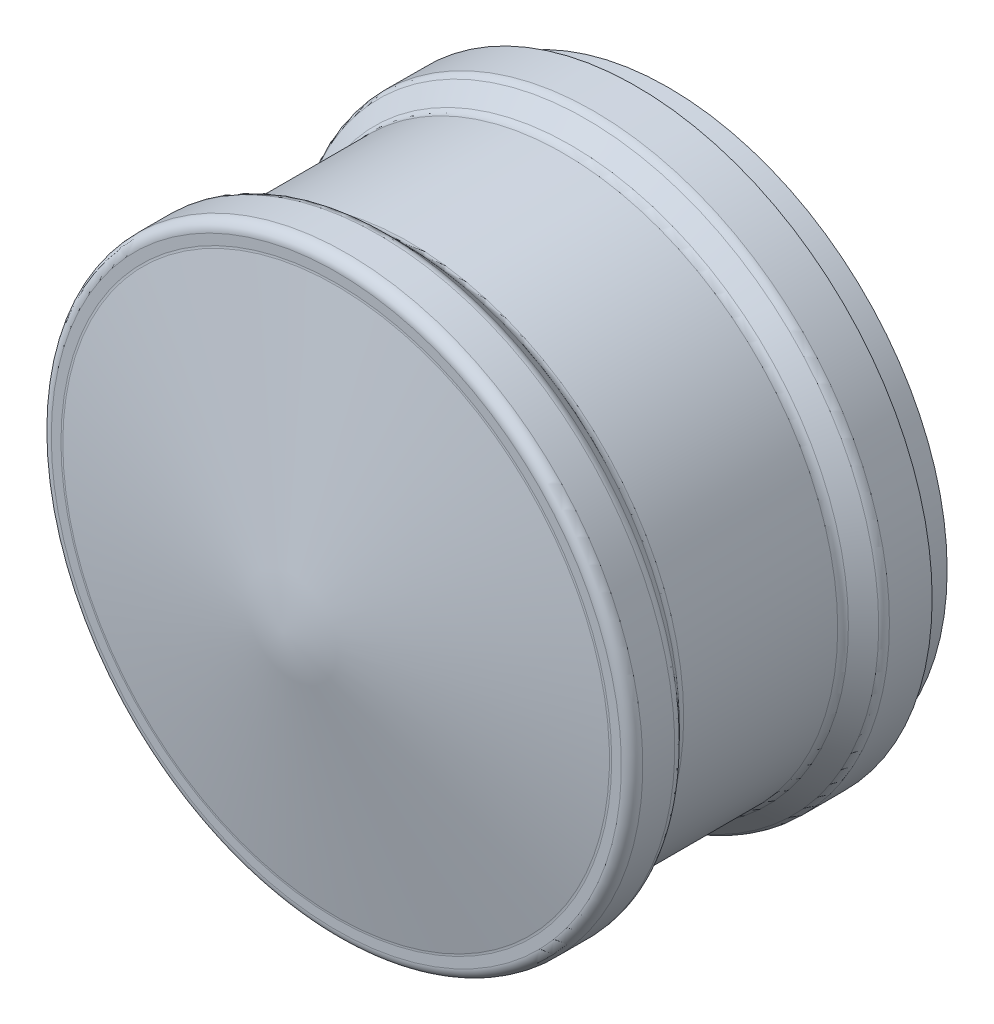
ISO-10303-21;
HEADER;
FILE_DESCRIPTION(('STEP AP214'),'2;1');
FILE_NAME('part.step','',(''),(''),'','','');
FILE_SCHEMA(('AUTOMOTIVE_DESIGN { 1 0 10303 214 1 1 1 1 }'));
ENDSEC;
DATA;
#1=APPLICATION_CONTEXT('core data for automotive mechanical design processes');
#2=APPLICATION_PROTOCOL_DEFINITION('international standard','automotive_design',2000,#1);
#3=PRODUCT_CONTEXT('',#1,'mechanical');
#4=PRODUCT('Part','Part','',(#3));
#5=PRODUCT_RELATED_PRODUCT_CATEGORY('part','',(#4));
#6=PRODUCT_DEFINITION_FORMATION('','',#4);
#7=PRODUCT_DEFINITION_CONTEXT('part definition',#1,'design');
#8=PRODUCT_DEFINITION('design','',#6,#7);
#9=PRODUCT_DEFINITION_SHAPE('','',#8);
#10=(LENGTH_UNIT() NAMED_UNIT(*) SI_UNIT(.MILLI.,.METRE.));
#11=(NAMED_UNIT(*) PLANE_ANGLE_UNIT() SI_UNIT($,.RADIAN.));
#12=(NAMED_UNIT(*) SI_UNIT($,.STERADIAN.) SOLID_ANGLE_UNIT());
#13=UNCERTAINTY_MEASURE_WITH_UNIT(LENGTH_MEASURE(1.E-05),#10,'distance_accuracy_value','');
#14=(GEOMETRIC_REPRESENTATION_CONTEXT(3) GLOBAL_UNCERTAINTY_ASSIGNED_CONTEXT((#13)) GLOBAL_UNIT_ASSIGNED_CONTEXT((#10,
#11,#12)) REPRESENTATION_CONTEXT('',''));
#15=CARTESIAN_POINT('',(0.,0.,0.));
#16=DIRECTION('',(0.,0.,1.));
#17=DIRECTION('',(1.,0.,0.));
#18=AXIS2_PLACEMENT_3D('',#15,#16,#17);
#19=CARTESIAN_POINT('',(0.,12.8,15.5));
#20=DIRECTION('',(0.,0.,-1.));
#21=DIRECTION('',(-1.,0.,0.));
#22=AXIS2_PLACEMENT_3D('',#19,#20,#21);
#23=PLANE('',#22);
#24=CARTESIAN_POINT('',(0.,0.,15.5));
#25=DIRECTION('',(0.,0.,-1.));
#26=DIRECTION('',(-1.,0.,0.));
#27=AXIS2_PLACEMENT_3D('',#24,#25,#26);
#28=CIRCLE('',#27,12.8483711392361);
#29=CARTESIAN_POINT('',(-12.8483711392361,0.,15.5));
#30=VERTEX_POINT('',#29);
#31=EDGE_CURVE('E156',#30,#30,#28,.T.);
#32=ORIENTED_EDGE('',*,*,#31,.T.);
#33=EDGE_LOOP('',(#32));
#34=FACE_BOUND('',#33,.T.);
#35=CARTESIAN_POINT('',(0.,0.,15.5));
#36=DIRECTION('',(0.,0.,-1.));
#37=DIRECTION('',(-1.,0.,0.));
#38=AXIS2_PLACEMENT_3D('',#35,#36,#37);
#39=CIRCLE('',#38,13.3);
#40=CARTESIAN_POINT('',(-13.3,0.,15.5));
#41=VERTEX_POINT('',#40);
#42=EDGE_CURVE('E153',#41,#41,#39,.F.);
#43=ORIENTED_EDGE('',*,*,#42,.T.);
#44=EDGE_LOOP('',(#43));
#45=FACE_BOUND('',#44,.T.);
#46=ADVANCED_FACE('F35',(#34,#45),#23,.F.);
#47=CARTESIAN_POINT('',(0.,0.,40.1566801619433));
#48=DIRECTION('',(0.,0.,1.));
#49=DIRECTION('',(1.,0.,0.));
#50=AXIS2_PLACEMENT_3D('',#47,#48,#49);
#51=CYLINDRICAL_SURFACE('',#50,13.8);
#52=CARTESIAN_POINT('',(0.,0.,15.));
#53=DIRECTION('',(0.,0.,-1.));
#54=DIRECTION('',(-1.,0.,0.));
#55=AXIS2_PLACEMENT_3D('',#52,#53,#54);
#56=CIRCLE('',#55,13.8);
#57=CARTESIAN_POINT('',(-13.8,0.,15.));
#58=VERTEX_POINT('',#57);
#59=EDGE_CURVE('E161',#58,#58,#56,.T.);
#60=ORIENTED_EDGE('',*,*,#59,.T.);
#61=EDGE_LOOP('',(#60));
#62=FACE_BOUND('',#61,.T.);
#63=CARTESIAN_POINT('',(0.,0.,13.5071067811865));
#64=DIRECTION('',(0.,0.,-1.));
#65=DIRECTION('',(-1.,0.,0.));
#66=AXIS2_PLACEMENT_3D('',#63,#64,#65);
#67=CIRCLE('',#66,13.8);
#68=CARTESIAN_POINT('',(-13.8,0.,13.5071067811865));
#69=VERTEX_POINT('',#68);
#70=EDGE_CURVE('E158',#69,#69,#67,.F.);
#71=ORIENTED_EDGE('',*,*,#70,.T.);
#72=EDGE_LOOP('',(#71));
#73=FACE_BOUND('',#72,.T.);
#74=ADVANCED_FACE('F67',(#62,#73),#51,.T.);
#75=CARTESIAN_POINT('',(0.,0.,12.3));
#76=DIRECTION('',(0.,0.,1.));
#77=DIRECTION('',(1.,0.,0.));
#78=AXIS2_PLACEMENT_3D('',#75,#76,#77);
#79=CONICAL_SURFACE('',#78,12.8,0.78539816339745);
#80=CARTESIAN_POINT('',(0.,0.,13.1535533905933));
#81=DIRECTION('',(0.,0.,-1.));
#82=DIRECTION('',(-1.,0.,0.));
#83=AXIS2_PLACEMENT_3D('',#80,#81,#82);
#84=CIRCLE('',#83,13.6535533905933);
#85=CARTESIAN_POINT('',(-13.6535533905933,0.,13.1535533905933));
#86=VERTEX_POINT('',#85);
#87=EDGE_CURVE('E109',#86,#86,#84,.T.);
#88=ORIENTED_EDGE('',*,*,#87,.T.);
#89=EDGE_LOOP('',(#88));
#90=FACE_BOUND('',#89,.T.);
#91=CARTESIAN_POINT('',(0.,0.,12.4464466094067));
#92=DIRECTION('',(0.,0.,1.));
#93=DIRECTION('',(1.,0.,0.));
#94=AXIS2_PLACEMENT_3D('',#91,#92,#93);
#95=CIRCLE('',#94,12.9464466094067);
#96=CARTESIAN_POINT('',(12.9464466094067,0.,12.4464466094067));
#97=VERTEX_POINT('',#96);
#98=EDGE_CURVE('E107',#97,#97,#95,.T.);
#99=ORIENTED_EDGE('',*,*,#98,.T.);
#100=EDGE_LOOP('',(#99));
#101=FACE_BOUND('',#100,.T.);
#102=ADVANCED_FACE('F73',(#90,#101),#79,.T.);
#103=CARTESIAN_POINT('',(0.,0.,40.1566801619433));
#104=DIRECTION('',(0.,0.,1.));
#105=DIRECTION('',(1.,0.,0.));
#106=AXIS2_PLACEMENT_3D('',#103,#104,#105);
#107=CYLINDRICAL_SURFACE('',#106,12.8);
#108=CARTESIAN_POINT('',(0.,0.,4.90710678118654));
#109=DIRECTION('',(0.,0.,1.));
#110=DIRECTION('',(1.,0.,0.));
#111=AXIS2_PLACEMENT_3D('',#108,#109,#110);
#112=CIRCLE('',#111,12.8);
#113=CARTESIAN_POINT('',(12.8,0.,4.90710678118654));
#114=VERTEX_POINT('',#113);
#115=EDGE_CURVE('E165',#114,#114,#112,.T.);
#116=ORIENTED_EDGE('',*,*,#115,.T.);
#117=EDGE_LOOP('',(#116));
#118=FACE_BOUND('',#117,.T.);
#119=CARTESIAN_POINT('',(0.,0.,12.0928932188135));
#120=DIRECTION('',(0.,0.,1.));
#121=DIRECTION('',(1.,0.,0.));
#122=AXIS2_PLACEMENT_3D('',#119,#120,#121);
#123=CIRCLE('',#122,12.8);
#124=CARTESIAN_POINT('',(12.8,0.,12.0928932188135));
#125=VERTEX_POINT('',#124);
#126=EDGE_CURVE('E104',#125,#125,#123,.F.);
#127=ORIENTED_EDGE('',*,*,#126,.T.);
#128=EDGE_LOOP('',(#127));
#129=FACE_BOUND('',#128,.T.);
#130=ADVANCED_FACE('F178',(#118,#129),#107,.T.);
#131=CARTESIAN_POINT('',(0.,0.,3.69999999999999));
#132=DIRECTION('',(0.,0.,-1.));
#133=DIRECTION('',(-1.,0.,0.));
#134=AXIS2_PLACEMENT_3D('',#131,#132,#133);
#135=CONICAL_SURFACE('',#134,13.8,0.785398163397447);
#136=CARTESIAN_POINT('',(0.,0.,4.55355339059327));
#137=DIRECTION('',(0.,0.,-1.));
#138=DIRECTION('',(-1.,0.,0.));
#139=AXIS2_PLACEMENT_3D('',#136,#137,#138);
#140=CIRCLE('',#139,12.9464466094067);
#141=CARTESIAN_POINT('',(-12.9464466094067,0.,4.55355339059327));
#142=VERTEX_POINT('',#141);
#143=EDGE_CURVE('E115',#142,#142,#140,.T.);
#144=ORIENTED_EDGE('',*,*,#143,.T.);
#145=EDGE_LOOP('',(#144));
#146=FACE_BOUND('',#145,.T.);
#147=CARTESIAN_POINT('',(0.,0.,3.84644660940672));
#148=DIRECTION('',(0.,0.,1.));
#149=DIRECTION('',(1.,0.,0.));
#150=AXIS2_PLACEMENT_3D('',#147,#148,#149);
#151=CIRCLE('',#150,13.6535533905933);
#152=CARTESIAN_POINT('',(13.6535533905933,0.,3.84644660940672));
#153=VERTEX_POINT('',#152);
#154=EDGE_CURVE('E168',#153,#153,#151,.T.);
#155=ORIENTED_EDGE('',*,*,#154,.T.);
#156=EDGE_LOOP('',(#155));
#157=FACE_BOUND('',#156,.T.);
#158=ADVANCED_FACE('F173',(#146,#157),#135,.T.);
#159=CARTESIAN_POINT('',(0.,0.,40.1566801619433));
#160=DIRECTION('',(0.,0.,1.));
#161=DIRECTION('',(1.,0.,0.));
#162=AXIS2_PLACEMENT_3D('',#159,#160,#161);
#163=CYLINDRICAL_SURFACE('',#162,13.8);
#164=CARTESIAN_POINT('',(0.,0.,3.49289321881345));
#165=DIRECTION('',(0.,0.,-1.));
#166=DIRECTION('',(-1.,0.,0.));
#167=AXIS2_PLACEMENT_3D('',#164,#165,#166);
#168=CIRCLE('',#167,13.8);
#169=CARTESIAN_POINT('',(-13.8,0.,3.49289321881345));
#170=VERTEX_POINT('',#169);
#171=EDGE_CURVE('E110',#170,#170,#168,.T.);
#172=ORIENTED_EDGE('',*,*,#171,.T.);
#173=EDGE_LOOP('',(#172));
#174=FACE_BOUND('',#173,.T.);
#175=CARTESIAN_POINT('',(0.,0.,1.5));
#176=DIRECTION('',(0.,0.,1.));
#177=DIRECTION('',(1.,0.,0.));
#178=AXIS2_PLACEMENT_3D('',#175,#176,#177);
#179=CIRCLE('',#178,13.8);
#180=CARTESIAN_POINT('',(13.8,0.,1.5));
#181=VERTEX_POINT('',#180);
#182=EDGE_CURVE('E148',#181,#181,#179,.T.);
#183=ORIENTED_EDGE('',*,*,#182,.T.);
#184=EDGE_LOOP('',(#183));
#185=FACE_BOUND('',#184,.T.);
#186=ADVANCED_FACE('F186',(#174,#185),#163,.T.);
#187=CARTESIAN_POINT('',(0.,13.8,1.5));
#188=DIRECTION('',(0.,0.,1.));
#189=DIRECTION('',(1.,0.,0.));
#190=AXIS2_PLACEMENT_3D('',#187,#188,#189);
#191=PLANE('',#190);
#192=ORIENTED_EDGE('',*,*,#182,.F.);
#193=EDGE_LOOP('',(#192));
#194=FACE_BOUND('',#193,.T.);
#195=CARTESIAN_POINT('',(0.,0.,1.5));
#196=DIRECTION('',(0.,0.,1.));
#197=DIRECTION('',(1.,0.,0.));
#198=AXIS2_PLACEMENT_3D('',#195,#196,#197);
#199=CIRCLE('',#198,12.5);
#200=CARTESIAN_POINT('',(12.5,0.,1.5));
#201=VERTEX_POINT('',#200);
#202=EDGE_CURVE('E145',#201,#201,#199,.T.);
#203=ORIENTED_EDGE('',*,*,#202,.T.);
#204=EDGE_LOOP('',(#203));
#205=FACE_BOUND('',#204,.T.);
#206=ADVANCED_FACE('F192',(#194,#205),#191,.F.);
#207=CARTESIAN_POINT('',(0.,0.,40.1566801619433));
#208=DIRECTION('',(0.,0.,1.));
#209=DIRECTION('',(1.,0.,0.));
#210=AXIS2_PLACEMENT_3D('',#207,#208,#209);
#211=CYLINDRICAL_SURFACE('',#210,12.5);
#212=ORIENTED_EDGE('',*,*,#202,.F.);
#213=EDGE_LOOP('',(#212));
#214=FACE_BOUND('',#213,.T.);
#215=CARTESIAN_POINT('',(0.,0.,1.2));
#216=DIRECTION('',(0.,0.,1.));
#217=DIRECTION('',(1.,0.,0.));
#218=AXIS2_PLACEMENT_3D('',#215,#216,#217);
#219=CIRCLE('',#218,12.5);
#220=CARTESIAN_POINT('',(12.5,0.,1.2));
#221=VERTEX_POINT('',#220);
#222=EDGE_CURVE('E136',#221,#221,#219,.T.);
#223=ORIENTED_EDGE('',*,*,#222,.T.);
#224=EDGE_LOOP('',(#223));
#225=FACE_BOUND('',#224,.T.);
#226=ADVANCED_FACE('F196',(#214,#225),#211,.T.);
#227=CARTESIAN_POINT('',(0.,12.5,1.2));
#228=DIRECTION('',(0.,0.,-1.));
#229=DIRECTION('',(-1.,0.,0.));
#230=AXIS2_PLACEMENT_3D('',#227,#228,#229);
#231=PLANE('',#230);
#232=ORIENTED_EDGE('',*,*,#222,.F.);
#233=EDGE_LOOP('',(#232));
#234=FACE_BOUND('',#233,.T.);
#235=CARTESIAN_POINT('',(0.,0.,1.2));
#236=DIRECTION('',(0.,0.,1.));
#237=DIRECTION('',(1.,0.,0.));
#238=AXIS2_PLACEMENT_3D('',#235,#236,#237);
#239=CIRCLE('',#238,13.);
#240=CARTESIAN_POINT('',(13.,0.,1.2));
#241=VERTEX_POINT('',#240);
#242=EDGE_CURVE('E132',#241,#241,#239,.T.);
#243=ORIENTED_EDGE('',*,*,#242,.T.);
#244=EDGE_LOOP('',(#243));
#245=FACE_BOUND('',#244,.T.);
#246=ADVANCED_FACE('F200',(#234,#245),#231,.F.);
#247=CARTESIAN_POINT('',(0.,0.,40.1566801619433));
#248=DIRECTION('',(0.,0.,1.));
#249=DIRECTION('',(1.,0.,0.));
#250=AXIS2_PLACEMENT_3D('',#247,#248,#249);
#251=CYLINDRICAL_SURFACE('',#250,13.);
#252=ORIENTED_EDGE('',*,*,#242,.F.);
#253=EDGE_LOOP('',(#252));
#254=FACE_BOUND('',#253,.T.);
#255=CARTESIAN_POINT('',(0.,0.,0.));
#256=DIRECTION('',(0.,0.,1.));
#257=DIRECTION('',(1.,0.,0.));
#258=AXIS2_PLACEMENT_3D('',#255,#256,#257);
#259=CIRCLE('',#258,13.);
#260=CARTESIAN_POINT('',(13.,0.,0.));
#261=VERTEX_POINT('',#260);
#262=EDGE_CURVE('E130',#261,#261,#259,.T.);
#263=ORIENTED_EDGE('',*,*,#262,.T.);
#264=EDGE_LOOP('',(#263));
#265=FACE_BOUND('',#264,.T.);
#266=ADVANCED_FACE('F126',(#254,#265),#251,.T.);
#267=CARTESIAN_POINT('',(0.,13.,0.));
#268=DIRECTION('',(0.,0.,1.));
#269=DIRECTION('',(1.,0.,0.));
#270=AXIS2_PLACEMENT_3D('',#267,#268,#269);
#271=PLANE('',#270);
#272=CARTESIAN_POINT('',(0.,0.,0.));
#273=DIRECTION('',(0.,0.,1.));
#274=DIRECTION('',(1.,0.,0.));
#275=AXIS2_PLACEMENT_3D('',#272,#273,#274);
#276=CIRCLE('',#275,8.9);
#277=CARTESIAN_POINT('',(8.9,0.,0.));
#278=VERTEX_POINT('',#277);
#279=EDGE_CURVE('E43',#278,#278,#276,.T.);
#280=ORIENTED_EDGE('',*,*,#279,.T.);
#281=EDGE_LOOP('',(#280));
#282=FACE_BOUND('',#281,.T.);
#283=ORIENTED_EDGE('',*,*,#262,.F.);
#284=EDGE_LOOP('',(#283));
#285=FACE_BOUND('',#284,.T.);
#286=ADVANCED_FACE('F121',(#282,#285),#271,.F.);
#287=CARTESIAN_POINT('',(0.,0.,40.1566801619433));
#288=DIRECTION('',(0.,0.,1.));
#289=DIRECTION('',(1.,0.,0.));
#290=AXIS2_PLACEMENT_3D('',#287,#288,#289);
#291=CYLINDRICAL_SURFACE('',#290,8.4);
#292=CARTESIAN_POINT('',(0.,0.,0.5));
#293=DIRECTION('',(0.,0.,1.));
#294=DIRECTION('',(1.,0.,0.));
#295=AXIS2_PLACEMENT_3D('',#292,#293,#294);
#296=CIRCLE('',#295,8.4);
#297=CARTESIAN_POINT('',(8.4,0.,0.5));
#298=VERTEX_POINT('',#297);
#299=EDGE_CURVE('E11',#298,#298,#296,.F.);
#300=ORIENTED_EDGE('',*,*,#299,.T.);
#301=EDGE_LOOP('',(#300));
#302=FACE_BOUND('',#301,.T.);
#303=CARTESIAN_POINT('',(0.,0.,3.2));
#304=DIRECTION('',(0.,0.,1.));
#305=DIRECTION('',(1.,0.,0.));
#306=AXIS2_PLACEMENT_3D('',#303,#304,#305);
#307=CIRCLE('',#306,8.4);
#308=CARTESIAN_POINT('',(8.4,0.,3.2));
#309=VERTEX_POINT('',#308);
#310=EDGE_CURVE('E133',#309,#309,#307,.T.);
#311=ORIENTED_EDGE('',*,*,#310,.T.);
#312=EDGE_LOOP('',(#311));
#313=FACE_BOUND('',#312,.T.);
#314=ADVANCED_FACE('F125',(#302,#313),#291,.F.);
#315=CARTESIAN_POINT('',(0.,8.4,3.2));
#316=DIRECTION('',(0.,0.,-1.));
#317=DIRECTION('',(-1.,0.,0.));
#318=AXIS2_PLACEMENT_3D('',#315,#316,#317);
#319=PLANE('',#318);
#320=ORIENTED_EDGE('',*,*,#310,.F.);
#321=EDGE_LOOP('',(#320));
#322=FACE_BOUND('',#321,.T.);
#323=CARTESIAN_POINT('',(0.,0.,3.2));
#324=DIRECTION('',(0.,0.,1.));
#325=DIRECTION('',(1.,0.,0.));
#326=AXIS2_PLACEMENT_3D('',#323,#324,#325);
#327=CIRCLE('',#326,9.9);
#328=CARTESIAN_POINT('',(9.9,0.,3.2));
#329=VERTEX_POINT('',#328);
#330=EDGE_CURVE('E139',#329,#329,#327,.T.);
#331=ORIENTED_EDGE('',*,*,#330,.T.);
#332=EDGE_LOOP('',(#331));
#333=FACE_BOUND('',#332,.T.);
#334=ADVANCED_FACE('F210',(#322,#333),#319,.F.);
#335=CARTESIAN_POINT('',(0.,0.,40.1566801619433));
#336=DIRECTION('',(0.,0.,1.));
#337=DIRECTION('',(1.,0.,0.));
#338=AXIS2_PLACEMENT_3D('',#335,#336,#337);
#339=CYLINDRICAL_SURFACE('',#338,9.9);
#340=ORIENTED_EDGE('',*,*,#330,.F.);
#341=EDGE_LOOP('',(#340));
#342=FACE_BOUND('',#341,.T.);
#343=CARTESIAN_POINT('',(0.,0.,4.6));
#344=DIRECTION('',(0.,0.,1.));
#345=DIRECTION('',(1.,0.,0.));
#346=AXIS2_PLACEMENT_3D('',#343,#344,#345);
#347=CIRCLE('',#346,9.9);
#348=CARTESIAN_POINT('',(9.9,0.,4.6));
#349=VERTEX_POINT('',#348);
#350=EDGE_CURVE('E226',#349,#349,#347,.T.);
#351=ORIENTED_EDGE('',*,*,#350,.T.);
#352=EDGE_LOOP('',(#351));
#353=FACE_BOUND('',#352,.T.);
#354=ADVANCED_FACE('F214',(#342,#353),#339,.F.);
#355=CARTESIAN_POINT('',(0.,9.9,4.6));
#356=DIRECTION('',(0.,0.,1.));
#357=DIRECTION('',(1.,0.,0.));
#358=AXIS2_PLACEMENT_3D('',#355,#356,#357);
#359=PLANE('',#358);
#360=ORIENTED_EDGE('',*,*,#350,.F.);
#361=EDGE_LOOP('',(#360));
#362=FACE_BOUND('',#361,.T.);
#363=CARTESIAN_POINT('',(0.,0.,4.6));
#364=DIRECTION('',(0.,0.,1.));
#365=DIRECTION('',(1.,0.,0.));
#366=AXIS2_PLACEMENT_3D('',#363,#364,#365);
#367=CIRCLE('',#366,8.6);
#368=CARTESIAN_POINT('',(8.6,0.,4.6));
#369=VERTEX_POINT('',#368);
#370=EDGE_CURVE('E229',#369,#369,#367,.T.);
#371=ORIENTED_EDGE('',*,*,#370,.T.);
#372=EDGE_LOOP('',(#371));
#373=FACE_BOUND('',#372,.T.);
#374=ADVANCED_FACE('F62',(#362,#373),#359,.F.);
#375=CARTESIAN_POINT('',(0.,0.,14.8));
#376=DIRECTION('',(0.,0.,-1.));
#377=DIRECTION('',(-1.,0.,0.));
#378=AXIS2_PLACEMENT_3D('',#375,#376,#377);
#379=CONICAL_SURFACE('',#378,0.,0.700496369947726);
#380=ORIENTED_EDGE('',*,*,#370,.F.);
#381=EDGE_LOOP('',(#380));
#382=FACE_BOUND('',#381,.T.);
#383=CARTESIAN_POINT('',(0.,0.,14.8));
#384=VERTEX_POINT('',#383);
#385=VERTEX_LOOP('',#384);
#386=FACE_BOUND('',#385,.T.);
#387=ADVANCED_FACE('F52',(#382,#386),#379,.F.);
#388=CARTESIAN_POINT('',(0.,0.,15.5));
#389=DIRECTION('',(0.,0.,-1.));
#390=DIRECTION('',(-1.,0.,0.));
#391=AXIS2_PLACEMENT_3D('',#388,#389,#390);
#392=CONICAL_SURFACE('',#391,12.8,1.37791201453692);
#393=CARTESIAN_POINT('',(0.,0.,15.5092722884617));
#394=DIRECTION('',(0.,0.,-1.));
#395=DIRECTION('',(-1.,0.,0.));
#396=AXIS2_PLACEMENT_3D('',#393,#394,#395);
#397=CIRCLE('',#396,12.7525258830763);
#398=CARTESIAN_POINT('',(-12.7525258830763,0.,15.5092722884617));
#399=VERTEX_POINT('',#398);
#400=EDGE_CURVE('E151',#399,#399,#397,.F.);
#401=ORIENTED_EDGE('',*,*,#400,.T.);
#402=EDGE_LOOP('',(#401));
#403=FACE_BOUND('',#402,.T.);
#404=CARTESIAN_POINT('',(0.,0.,18.));
#405=VERTEX_POINT('',#404);
#406=VERTEX_LOOP('',#405);
#407=FACE_BOUND('',#406,.T.);
#408=ADVANCED_FACE('F49',(#403,#407),#392,.T.);
#409=CARTESIAN_POINT('',(0.,0.,16.));
#410=DIRECTION('',(0.,0.,-1.));
#411=DIRECTION('',(-1.,0.,0.));
#412=AXIS2_PLACEMENT_3D('',#409,#410,#411);
#413=TOROIDAL_SURFACE('',#412,12.8483711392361,0.5);
#414=ORIENTED_EDGE('',*,*,#31,.F.);
#415=EDGE_LOOP('',(#414));
#416=FACE_BOUND('',#415,.T.);
#417=ORIENTED_EDGE('',*,*,#400,.F.);
#418=EDGE_LOOP('',(#417));
#419=FACE_BOUND('',#418,.T.);
#420=ADVANCED_FACE('F51',(#416,#419),#413,.F.);
#421=CARTESIAN_POINT('',(0.,0.,15.));
#422=DIRECTION('',(0.,0.,-1.));
#423=DIRECTION('',(-1.,0.,0.));
#424=AXIS2_PLACEMENT_3D('',#421,#422,#423);
#425=TOROIDAL_SURFACE('',#424,13.3,0.5);
#426=ORIENTED_EDGE('',*,*,#59,.F.);
#427=EDGE_LOOP('',(#426));
#428=FACE_BOUND('',#427,.T.);
#429=ORIENTED_EDGE('',*,*,#42,.F.);
#430=EDGE_LOOP('',(#429));
#431=FACE_BOUND('',#430,.T.);
#432=ADVANCED_FACE('F59',(#428,#431),#425,.T.);
#433=CARTESIAN_POINT('',(0.,0.,4.90710678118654));
#434=DIRECTION('',(0.,0.,1.));
#435=DIRECTION('',(1.,0.,0.));
#436=AXIS2_PLACEMENT_3D('',#433,#434,#435);
#437=TOROIDAL_SURFACE('',#436,13.3,0.5);
#438=ORIENTED_EDGE('',*,*,#143,.F.);
#439=EDGE_LOOP('',(#438));
#440=FACE_BOUND('',#439,.T.);
#441=ORIENTED_EDGE('',*,*,#115,.F.);
#442=EDGE_LOOP('',(#441));
#443=FACE_BOUND('',#442,.T.);
#444=ADVANCED_FACE('F82',(#440,#443),#437,.F.);
#445=CARTESIAN_POINT('',(0.,0.,3.49289321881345));
#446=DIRECTION('',(0.,0.,-1.));
#447=DIRECTION('',(-1.,0.,0.));
#448=AXIS2_PLACEMENT_3D('',#445,#446,#447);
#449=TOROIDAL_SURFACE('',#448,13.3,0.5);
#450=ORIENTED_EDGE('',*,*,#171,.F.);
#451=EDGE_LOOP('',(#450));
#452=FACE_BOUND('',#451,.T.);
#453=ORIENTED_EDGE('',*,*,#154,.F.);
#454=EDGE_LOOP('',(#453));
#455=FACE_BOUND('',#454,.T.);
#456=ADVANCED_FACE('F86',(#452,#455),#449,.T.);
#457=CARTESIAN_POINT('',(0.,0.,13.5071067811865));
#458=DIRECTION('',(0.,0.,-1.));
#459=DIRECTION('',(-1.,0.,0.));
#460=AXIS2_PLACEMENT_3D('',#457,#458,#459);
#461=TOROIDAL_SURFACE('',#460,13.3,0.5);
#462=ORIENTED_EDGE('',*,*,#87,.F.);
#463=EDGE_LOOP('',(#462));
#464=FACE_BOUND('',#463,.T.);
#465=ORIENTED_EDGE('',*,*,#70,.F.);
#466=EDGE_LOOP('',(#465));
#467=FACE_BOUND('',#466,.T.);
#468=ADVANCED_FACE('F90',(#464,#467),#461,.T.);
#469=CARTESIAN_POINT('',(0.,0.,12.0928932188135));
#470=DIRECTION('',(0.,0.,1.));
#471=DIRECTION('',(1.,0.,0.));
#472=AXIS2_PLACEMENT_3D('',#469,#470,#471);
#473=TOROIDAL_SURFACE('',#472,13.3,0.5);
#474=ORIENTED_EDGE('',*,*,#126,.F.);
#475=EDGE_LOOP('',(#474));
#476=FACE_BOUND('',#475,.T.);
#477=ORIENTED_EDGE('',*,*,#98,.F.);
#478=EDGE_LOOP('',(#477));
#479=FACE_BOUND('',#478,.T.);
#480=ADVANCED_FACE('F93',(#476,#479),#473,.F.);
#481=CARTESIAN_POINT('',(0.,0.,0.));
#482=DIRECTION('',(0.,0.,-1.));
#483=DIRECTION('',(-1.,0.,0.));
#484=AXIS2_PLACEMENT_3D('',#481,#482,#483);
#485=CONICAL_SURFACE('',#484,8.9,0.785398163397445);
#486=ORIENTED_EDGE('',*,*,#299,.F.);
#487=EDGE_LOOP('',(#486));
#488=FACE_BOUND('',#487,.T.);
#489=ORIENTED_EDGE('',*,*,#279,.F.);
#490=EDGE_LOOP('',(#489));
#491=FACE_BOUND('',#490,.T.);
#492=ADVANCED_FACE('F37',(#488,#491),#485,.F.);
#493=CLOSED_SHELL('',(#46,#74,#102,#130,#158,#186,#206,#226,#246,#266,#286,#314,#334,#354,#374,
#387,#408,#420,#432,#444,#456,#468,#480,#492));
#494=MANIFOLD_SOLID_BREP('B2',#493);
#495=ADVANCED_BREP_SHAPE_REPRESENTATION('',(#18,#494),#14);
#496=SHAPE_DEFINITION_REPRESENTATION(#9,#495);
ENDSEC;
END-ISO-10303-21;
